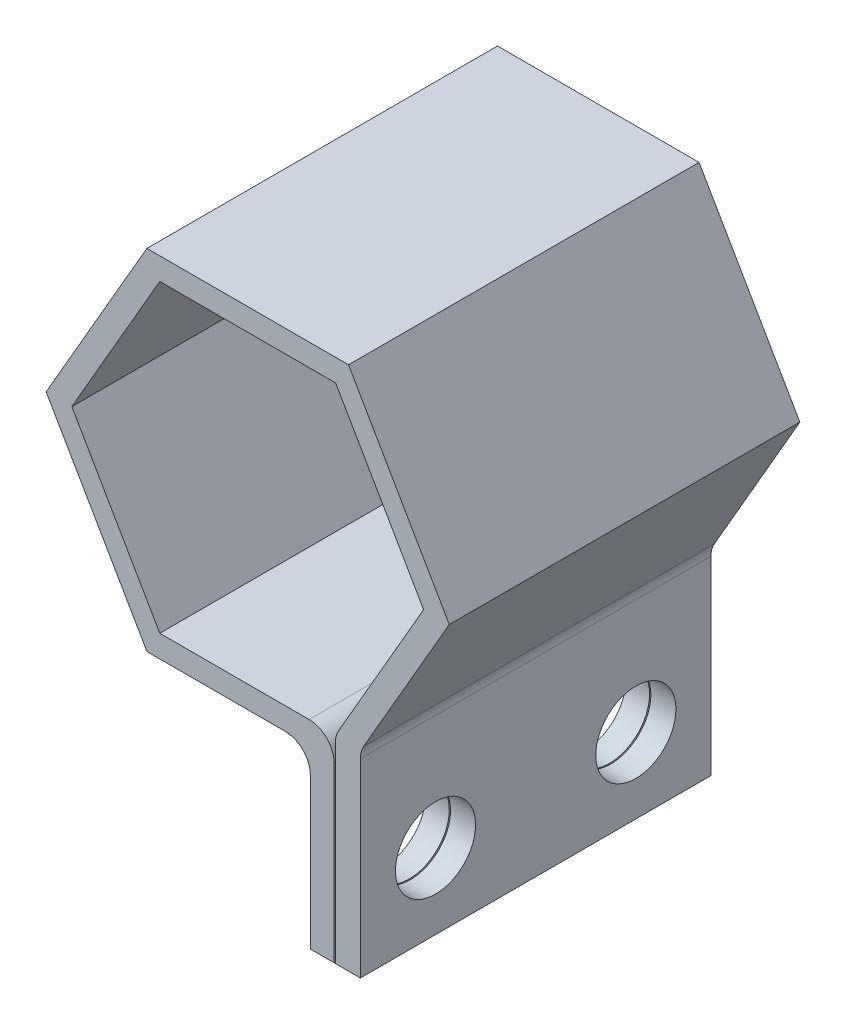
ISO-10303-21;
HEADER;
FILE_DESCRIPTION(('STEP AP214'),'2;1');
FILE_NAME('part.step','',(''),(''),'','','');
FILE_SCHEMA(('AUTOMOTIVE_DESIGN { 1 0 10303 214 1 1 1 1 }'));
ENDSEC;
DATA;
#1=APPLICATION_CONTEXT('core data for automotive mechanical design processes');
#2=APPLICATION_PROTOCOL_DEFINITION('international standard','automotive_design',2000,#1);
#3=PRODUCT_CONTEXT('',#1,'mechanical');
#4=PRODUCT('Part','Part','',(#3));
#5=PRODUCT_RELATED_PRODUCT_CATEGORY('part','',(#4));
#6=PRODUCT_DEFINITION_FORMATION('','',#4);
#7=PRODUCT_DEFINITION_CONTEXT('part definition',#1,'design');
#8=PRODUCT_DEFINITION('design','',#6,#7);
#9=PRODUCT_DEFINITION_SHAPE('','',#8);
#10=(LENGTH_UNIT() NAMED_UNIT(*) SI_UNIT(.MILLI.,.METRE.));
#11=(NAMED_UNIT(*) PLANE_ANGLE_UNIT() SI_UNIT($,.RADIAN.));
#12=(NAMED_UNIT(*) SI_UNIT($,.STERADIAN.) SOLID_ANGLE_UNIT());
#13=UNCERTAINTY_MEASURE_WITH_UNIT(LENGTH_MEASURE(1.E-05),#10,'distance_accuracy_value','');
#14=(GEOMETRIC_REPRESENTATION_CONTEXT(3) GLOBAL_UNCERTAINTY_ASSIGNED_CONTEXT((#13)) GLOBAL_UNIT_ASSIGNED_CONTEXT((#10,
#11,#12)) REPRESENTATION_CONTEXT('',''));
#15=CARTESIAN_POINT('',(0.,0.,0.));
#16=DIRECTION('',(0.,0.,1.));
#17=DIRECTION('',(1.,0.,0.));
#18=AXIS2_PLACEMENT_3D('',#15,#16,#17);
#19=CARTESIAN_POINT('',(4.63397459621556,-5.91672955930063,14.));
#20=DIRECTION('',(-0.866025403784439,0.499999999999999,0.));
#21=DIRECTION('',(-0.499999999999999,-0.866025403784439,0.));
#22=AXIS2_PLACEMENT_3D('',#19,#20,#21);
#23=PLANE('',#22);
#24=DIRECTION('',(0.499999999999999,0.866025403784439,0.));
#25=VECTOR('',#24,1.);
#26=CARTESIAN_POINT('',(4.63397459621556,-5.91672955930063,0.));
#27=LINE('',#26,#25);
#28=CARTESIAN_POINT('',(4.63397459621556,-5.91672955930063,0.));
#29=VERTEX_POINT('',#28);
#30=CARTESIAN_POINT('',(8.05,0.,0.));
#31=VERTEX_POINT('',#30);
#32=EDGE_CURVE('E212',#29,#31,#27,.T.);
#33=ORIENTED_EDGE('',*,*,#32,.T.);
#34=DIRECTION('',(0.,0.,-1.));
#35=VECTOR('',#34,1.);
#36=CARTESIAN_POINT('',(8.05,0.,14.));
#37=LINE('',#36,#35);
#38=CARTESIAN_POINT('',(8.05,0.,14.));
#39=VERTEX_POINT('',#38);
#40=EDGE_CURVE('E11',#39,#31,#37,.T.);
#41=ORIENTED_EDGE('',*,*,#40,.F.);
#42=DIRECTION('',(0.499999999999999,0.866025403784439,0.));
#43=VECTOR('',#42,1.);
#44=CARTESIAN_POINT('',(4.63397459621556,-5.91672955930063,14.));
#45=LINE('',#44,#43);
#46=CARTESIAN_POINT('',(4.63397459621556,-5.91672955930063,14.));
#47=VERTEX_POINT('',#46);
#48=EDGE_CURVE('E255',#47,#39,#45,.T.);
#49=ORIENTED_EDGE('',*,*,#48,.F.);
#50=DIRECTION('',(0.,0.,-1.));
#51=VECTOR('',#50,1.);
#52=CARTESIAN_POINT('',(4.63397459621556,-5.91672955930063,14.));
#53=LINE('',#52,#51);
#54=EDGE_CURVE('E208',#47,#29,#53,.T.);
#55=ORIENTED_EDGE('',*,*,#54,.T.);
#56=EDGE_LOOP('',(#33,#41,#49,#55));
#57=FACE_BOUND('',#56,.T.);
#58=ADVANCED_FACE('F32',(#57),#23,.F.);
#59=CARTESIAN_POINT('',(8.05,0.,14.));
#60=DIRECTION('',(-0.866025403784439,-0.5,0.));
#61=DIRECTION('',(0.5,-0.866025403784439,0.));
#62=AXIS2_PLACEMENT_3D('',#59,#60,#61);
#63=PLANE('',#62);
#64=DIRECTION('',(-0.5,0.866025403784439,0.));
#65=VECTOR('',#64,1.);
#66=CARTESIAN_POINT('',(8.05,0.,0.));
#67=LINE('',#66,#65);
#68=CARTESIAN_POINT('',(4.025,6.97150450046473,0.));
#69=VERTEX_POINT('',#68);
#70=EDGE_CURVE('E215',#31,#69,#67,.T.);
#71=ORIENTED_EDGE('',*,*,#70,.T.);
#72=DIRECTION('',(0.,0.,-1.));
#73=VECTOR('',#72,1.);
#74=CARTESIAN_POINT('',(4.025,6.97150450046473,14.));
#75=LINE('',#74,#73);
#76=CARTESIAN_POINT('',(4.025,6.97150450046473,14.));
#77=VERTEX_POINT('',#76);
#78=EDGE_CURVE('E40',#77,#69,#75,.T.);
#79=ORIENTED_EDGE('',*,*,#78,.F.);
#80=DIRECTION('',(-0.5,0.866025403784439,0.));
#81=VECTOR('',#80,1.);
#82=CARTESIAN_POINT('',(8.05,0.,14.));
#83=LINE('',#82,#81);
#84=EDGE_CURVE('E133',#39,#77,#83,.T.);
#85=ORIENTED_EDGE('',*,*,#84,.F.);
#86=ORIENTED_EDGE('',*,*,#40,.T.);
#87=EDGE_LOOP('',(#71,#79,#85,#86));
#88=FACE_BOUND('',#87,.T.);
#89=ADVANCED_FACE('F384',(#88),#63,.F.);
#90=CARTESIAN_POINT('',(4.025,6.97150450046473,14.));
#91=DIRECTION('',(0.,-1.,0.));
#92=DIRECTION('',(0.,0.,-1.));
#93=AXIS2_PLACEMENT_3D('',#90,#91,#92);
#94=PLANE('',#93);
#95=DIRECTION('',(-1.,0.,0.));
#96=VECTOR('',#95,1.);
#97=CARTESIAN_POINT('',(4.025,6.97150450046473,0.));
#98=LINE('',#97,#96);
#99=CARTESIAN_POINT('',(-4.025,6.97150450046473,0.));
#100=VERTEX_POINT('',#99);
#101=EDGE_CURVE('E218',#69,#100,#98,.T.);
#102=ORIENTED_EDGE('',*,*,#101,.T.);
#103=DIRECTION('',(0.,0.,-1.));
#104=VECTOR('',#103,1.);
#105=CARTESIAN_POINT('',(-4.025,6.97150450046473,14.));
#106=LINE('',#105,#104);
#107=CARTESIAN_POINT('',(-4.025,6.97150450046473,14.));
#108=VERTEX_POINT('',#107);
#109=EDGE_CURVE('E304',#108,#100,#106,.T.);
#110=ORIENTED_EDGE('',*,*,#109,.F.);
#111=DIRECTION('',(-1.,0.,0.));
#112=VECTOR('',#111,1.);
#113=CARTESIAN_POINT('',(4.025,6.97150450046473,14.));
#114=LINE('',#113,#112);
#115=EDGE_CURVE('E312',#77,#108,#114,.T.);
#116=ORIENTED_EDGE('',*,*,#115,.F.);
#117=ORIENTED_EDGE('',*,*,#78,.T.);
#118=EDGE_LOOP('',(#102,#110,#116,#117));
#119=FACE_BOUND('',#118,.T.);
#120=ADVANCED_FACE('F310',(#119),#94,.F.);
#121=CARTESIAN_POINT('',(-4.025,6.97150450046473,14.));
#122=DIRECTION('',(0.866025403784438,-0.500000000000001,0.));
#123=DIRECTION('',(0.500000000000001,0.866025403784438,0.));
#124=AXIS2_PLACEMENT_3D('',#121,#122,#123);
#125=PLANE('',#124);
#126=DIRECTION('',(-0.500000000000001,-0.866025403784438,0.));
#127=VECTOR('',#126,1.);
#128=CARTESIAN_POINT('',(-4.025,6.97150450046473,0.));
#129=LINE('',#128,#127);
#130=CARTESIAN_POINT('',(-8.05,0.,0.));
#131=VERTEX_POINT('',#130);
#132=EDGE_CURVE('E220',#100,#131,#129,.T.);
#133=ORIENTED_EDGE('',*,*,#132,.T.);
#134=DIRECTION('',(0.,0.,-1.));
#135=VECTOR('',#134,1.);
#136=CARTESIAN_POINT('',(-8.05,0.,14.));
#137=LINE('',#136,#135);
#138=CARTESIAN_POINT('',(-8.05,0.,14.));
#139=VERTEX_POINT('',#138);
#140=EDGE_CURVE('E301',#139,#131,#137,.T.);
#141=ORIENTED_EDGE('',*,*,#140,.F.);
#142=DIRECTION('',(-0.500000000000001,-0.866025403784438,0.));
#143=VECTOR('',#142,1.);
#144=CARTESIAN_POINT('',(-4.025,6.97150450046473,14.));
#145=LINE('',#144,#143);
#146=EDGE_CURVE('E330',#108,#139,#145,.T.);
#147=ORIENTED_EDGE('',*,*,#146,.F.);
#148=ORIENTED_EDGE('',*,*,#109,.T.);
#149=EDGE_LOOP('',(#133,#141,#147,#148));
#150=FACE_BOUND('',#149,.T.);
#151=ADVANCED_FACE('F321',(#150),#125,.F.);
#152=CARTESIAN_POINT('',(-8.05,0.,14.));
#153=DIRECTION('',(0.866025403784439,0.5,0.));
#154=DIRECTION('',(-0.5,0.866025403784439,0.));
#155=AXIS2_PLACEMENT_3D('',#152,#153,#154);
#156=PLANE('',#155);
#157=DIRECTION('',(0.5,-0.866025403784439,0.));
#158=VECTOR('',#157,1.);
#159=CARTESIAN_POINT('',(-8.05,0.,0.));
#160=LINE('',#159,#158);
#161=CARTESIAN_POINT('',(-4.025,-6.97150450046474,0.));
#162=VERTEX_POINT('',#161);
#163=EDGE_CURVE('E222',#131,#162,#160,.T.);
#164=ORIENTED_EDGE('',*,*,#163,.T.);
#165=DIRECTION('',(0.,0.,-1.));
#166=VECTOR('',#165,1.);
#167=CARTESIAN_POINT('',(-4.025,-6.97150450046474,14.));
#168=LINE('',#167,#166);
#169=CARTESIAN_POINT('',(-4.025,-6.97150450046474,14.));
#170=VERTEX_POINT('',#169);
#171=EDGE_CURVE('E298',#170,#162,#168,.T.);
#172=ORIENTED_EDGE('',*,*,#171,.F.);
#173=DIRECTION('',(0.5,-0.866025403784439,0.));
#174=VECTOR('',#173,1.);
#175=CARTESIAN_POINT('',(-8.05,0.,14.));
#176=LINE('',#175,#174);
#177=EDGE_CURVE('E327',#139,#170,#176,.T.);
#178=ORIENTED_EDGE('',*,*,#177,.F.);
#179=ORIENTED_EDGE('',*,*,#140,.T.);
#180=EDGE_LOOP('',(#164,#172,#178,#179));
#181=FACE_BOUND('',#180,.T.);
#182=ADVANCED_FACE('F325',(#181),#156,.F.);
#183=CARTESIAN_POINT('',(-4.025,-6.97150450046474,14.));
#184=DIRECTION('',(0.,1.,0.));
#185=DIRECTION('',(-1.,0.,0.));
#186=AXIS2_PLACEMENT_3D('',#183,#184,#185);
#187=PLANE('',#186);
#188=DIRECTION('',(1.,0.,0.));
#189=VECTOR('',#188,1.);
#190=CARTESIAN_POINT('',(-4.025,-6.97150450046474,0.));
#191=LINE('',#190,#189);
#192=CARTESIAN_POINT('',(1.49999999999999,-6.97150450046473,0.));
#193=VERTEX_POINT('',#192);
#194=EDGE_CURVE('E224',#162,#193,#191,.T.);
#195=ORIENTED_EDGE('',*,*,#194,.T.);
#196=DIRECTION('',(0.,0.,-1.));
#197=VECTOR('',#196,1.);
#198=CARTESIAN_POINT('',(1.49999999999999,-6.97150450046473,14.));
#199=LINE('',#198,#197);
#200=CARTESIAN_POINT('',(1.49999999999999,-6.97150450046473,14.));
#201=VERTEX_POINT('',#200);
#202=EDGE_CURVE('E295',#201,#193,#199,.T.);
#203=ORIENTED_EDGE('',*,*,#202,.F.);
#204=DIRECTION('',(1.,0.,0.));
#205=VECTOR('',#204,1.);
#206=CARTESIAN_POINT('',(-4.025,-6.97150450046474,14.));
#207=LINE('',#206,#205);
#208=EDGE_CURVE('E329',#170,#201,#207,.T.);
#209=ORIENTED_EDGE('',*,*,#208,.F.);
#210=ORIENTED_EDGE('',*,*,#171,.T.);
#211=EDGE_LOOP('',(#195,#203,#209,#210));
#212=FACE_BOUND('',#211,.T.);
#213=ADVANCED_FACE('F397',(#212),#187,.F.);
#214=CARTESIAN_POINT('',(1.5,-7.97150450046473,14.));
#215=DIRECTION('',(0.,0.,-1.));
#216=DIRECTION('',(-1.,0.,0.));
#217=AXIS2_PLACEMENT_3D('',#214,#215,#216);
#218=CYLINDRICAL_SURFACE('',#217,1.);
#219=CARTESIAN_POINT('',(1.5,-7.97150450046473,0.));
#220=DIRECTION('',(0.,0.,-1.));
#221=DIRECTION('',(-1.,0.,0.));
#222=AXIS2_PLACEMENT_3D('',#219,#220,#221);
#223=CIRCLE('',#222,1.);
#224=CARTESIAN_POINT('',(2.5,-7.97150450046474,0.));
#225=VERTEX_POINT('',#224);
#226=EDGE_CURVE('E226',#193,#225,#223,.T.);
#227=ORIENTED_EDGE('',*,*,#226,.T.);
#228=DIRECTION('',(0.,0.,-1.));
#229=VECTOR('',#228,1.);
#230=CARTESIAN_POINT('',(2.5,-7.97150450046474,14.));
#231=LINE('',#230,#229);
#232=CARTESIAN_POINT('',(2.5,-7.97150450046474,14.));
#233=VERTEX_POINT('',#232);
#234=EDGE_CURVE('E292',#233,#225,#231,.T.);
#235=ORIENTED_EDGE('',*,*,#234,.F.);
#236=CARTESIAN_POINT('',(1.5,-7.97150450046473,14.));
#237=DIRECTION('',(0.,0.,-1.));
#238=DIRECTION('',(-1.,0.,0.));
#239=AXIS2_PLACEMENT_3D('',#236,#237,#238);
#240=CIRCLE('',#239,1.);
#241=EDGE_CURVE('E332',#201,#233,#240,.T.);
#242=ORIENTED_EDGE('',*,*,#241,.F.);
#243=ORIENTED_EDGE('',*,*,#202,.T.);
#244=EDGE_LOOP('',(#227,#235,#242,#243));
#245=FACE_BOUND('',#244,.T.);
#246=ADVANCED_FACE('F400',(#245),#218,.F.);
#247=CARTESIAN_POINT('',(2.5,-7.97150450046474,14.));
#248=DIRECTION('',(1.,0.,0.));
#249=DIRECTION('',(0.,1.,0.));
#250=AXIS2_PLACEMENT_3D('',#247,#248,#249);
#251=PLANE('',#250);
#252=CARTESIAN_POINT('',(2.5,-11.,3.));
#253=DIRECTION('',(1.,0.,0.));
#254=DIRECTION('',(0.,1.,0.));
#255=AXIS2_PLACEMENT_3D('',#252,#253,#254);
#256=CIRCLE('',#255,1.6);
#257=CARTESIAN_POINT('',(2.5,-9.4,3.));
#258=VERTEX_POINT('',#257);
#259=EDGE_CURVE('E631',#258,#258,#256,.F.);
#260=ORIENTED_EDGE('',*,*,#259,.F.);
#261=EDGE_LOOP('',(#260));
#262=FACE_BOUND('',#261,.T.);
#263=CARTESIAN_POINT('',(2.5,-11.,11.));
#264=DIRECTION('',(1.,0.,0.));
#265=DIRECTION('',(0.,1.,0.));
#266=AXIS2_PLACEMENT_3D('',#263,#264,#265);
#267=CIRCLE('',#266,1.6);
#268=CARTESIAN_POINT('',(2.5,-9.4,11.));
#269=VERTEX_POINT('',#268);
#270=EDGE_CURVE('E639',#269,#269,#267,.F.);
#271=ORIENTED_EDGE('',*,*,#270,.F.);
#272=EDGE_LOOP('',(#271));
#273=FACE_BOUND('',#272,.T.);
#274=DIRECTION('',(0.,-1.,0.));
#275=VECTOR('',#274,1.);
#276=CARTESIAN_POINT('',(2.5,-7.97150450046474,0.));
#277=LINE('',#276,#275);
#278=CARTESIAN_POINT('',(2.5,-14.,0.));
#279=VERTEX_POINT('',#278);
#280=EDGE_CURVE('E228',#225,#279,#277,.T.);
#281=ORIENTED_EDGE('',*,*,#280,.T.);
#282=DIRECTION('',(0.,0.,-1.));
#283=VECTOR('',#282,1.);
#284=CARTESIAN_POINT('',(2.5,-14.,14.));
#285=LINE('',#284,#283);
#286=CARTESIAN_POINT('',(2.5,-14.,14.));
#287=VERTEX_POINT('',#286);
#288=EDGE_CURVE('E289',#287,#279,#285,.T.);
#289=ORIENTED_EDGE('',*,*,#288,.F.);
#290=DIRECTION('',(0.,-1.,0.));
#291=VECTOR('',#290,1.);
#292=CARTESIAN_POINT('',(2.5,-7.97150450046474,14.));
#293=LINE('',#292,#291);
#294=EDGE_CURVE('E338',#233,#287,#293,.T.);
#295=ORIENTED_EDGE('',*,*,#294,.F.);
#296=ORIENTED_EDGE('',*,*,#234,.T.);
#297=EDGE_LOOP('',(#281,#289,#295,#296));
#298=FACE_BOUND('',#297,.T.);
#299=ADVANCED_FACE('F404',(#262,#273,#298),#251,.F.);
#300=CARTESIAN_POINT('',(3.45,-14.,14.));
#301=DIRECTION('',(0.,1.,0.));
#302=DIRECTION('',(0.,0.,1.));
#303=AXIS2_PLACEMENT_3D('',#300,#301,#302);
#304=PLANE('',#303);
#305=DIRECTION('',(1.,0.,0.));
#306=VECTOR('',#305,1.);
#307=CARTESIAN_POINT('',(3.45,-14.,0.));
#308=LINE('',#307,#306);
#309=CARTESIAN_POINT('',(3.45,-14.,0.));
#310=VERTEX_POINT('',#309);
#311=EDGE_CURVE('E230',#279,#310,#308,.T.);
#312=ORIENTED_EDGE('',*,*,#311,.T.);
#313=DIRECTION('',(0.,0.,-1.));
#314=VECTOR('',#313,1.);
#315=CARTESIAN_POINT('',(3.45,-14.,14.));
#316=LINE('',#315,#314);
#317=CARTESIAN_POINT('',(3.45,-14.,14.));
#318=VERTEX_POINT('',#317);
#319=EDGE_CURVE('E286',#318,#310,#316,.T.);
#320=ORIENTED_EDGE('',*,*,#319,.F.);
#321=DIRECTION('',(1.,0.,0.));
#322=VECTOR('',#321,1.);
#323=CARTESIAN_POINT('',(3.45,-14.,14.));
#324=LINE('',#323,#322);
#325=EDGE_CURVE('E340',#287,#318,#324,.T.);
#326=ORIENTED_EDGE('',*,*,#325,.F.);
#327=ORIENTED_EDGE('',*,*,#288,.T.);
#328=EDGE_LOOP('',(#312,#320,#326,#327));
#329=FACE_BOUND('',#328,.T.);
#330=ADVANCED_FACE('F408',(#329),#304,.F.);
#331=CARTESIAN_POINT('',(3.45,-7.08382846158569,14.));
#332=DIRECTION('',(-1.,0.,0.));
#333=DIRECTION('',(0.,-1.,0.));
#334=AXIS2_PLACEMENT_3D('',#331,#332,#333);
#335=PLANE('',#334);
#336=CARTESIAN_POINT('',(3.45,-11.,3.));
#337=DIRECTION('',(-1.,0.,0.));
#338=DIRECTION('',(0.,-1.,0.));
#339=AXIS2_PLACEMENT_3D('',#336,#337,#338);
#340=CIRCLE('',#339,1.6);
#341=CARTESIAN_POINT('',(3.45,-9.4,3.));
#342=VERTEX_POINT('',#341);
#343=EDGE_CURVE('E634',#342,#342,#340,.T.);
#344=ORIENTED_EDGE('',*,*,#343,.T.);
#345=EDGE_LOOP('',(#344));
#346=FACE_BOUND('',#345,.T.);
#347=CARTESIAN_POINT('',(3.45,-11.,11.));
#348=DIRECTION('',(-1.,0.,0.));
#349=DIRECTION('',(0.,-1.,0.));
#350=AXIS2_PLACEMENT_3D('',#347,#348,#349);
#351=CIRCLE('',#350,1.6);
#352=CARTESIAN_POINT('',(3.45,-9.4,11.));
#353=VERTEX_POINT('',#352);
#354=EDGE_CURVE('E216',#353,#353,#351,.T.);
#355=ORIENTED_EDGE('',*,*,#354,.T.);
#356=EDGE_LOOP('',(#355));
#357=FACE_BOUND('',#356,.T.);
#358=DIRECTION('',(0.,1.,0.));
#359=VECTOR('',#358,1.);
#360=CARTESIAN_POINT('',(3.45,-7.08382846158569,0.));
#361=LINE('',#360,#359);
#362=CARTESIAN_POINT('',(3.45,-7.08382846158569,0.));
#363=VERTEX_POINT('',#362);
#364=EDGE_CURVE('E232',#310,#363,#361,.T.);
#365=ORIENTED_EDGE('',*,*,#364,.T.);
#366=DIRECTION('',(0.,0.,-1.));
#367=VECTOR('',#366,1.);
#368=CARTESIAN_POINT('',(3.45,-7.08382846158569,14.));
#369=LINE('',#368,#367);
#370=CARTESIAN_POINT('',(3.45,-7.08382846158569,14.));
#371=VERTEX_POINT('',#370);
#372=EDGE_CURVE('E283',#371,#363,#369,.T.);
#373=ORIENTED_EDGE('',*,*,#372,.F.);
#374=DIRECTION('',(0.,1.,0.));
#375=VECTOR('',#374,1.);
#376=CARTESIAN_POINT('',(3.45,-7.08382846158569,14.));
#377=LINE('',#376,#375);
#378=EDGE_CURVE('E342',#318,#371,#377,.T.);
#379=ORIENTED_EDGE('',*,*,#378,.F.);
#380=ORIENTED_EDGE('',*,*,#319,.T.);
#381=EDGE_LOOP('',(#365,#373,#379,#380));
#382=FACE_BOUND('',#381,.T.);
#383=ADVANCED_FACE('F412',(#346,#357,#382),#335,.F.);
#384=CARTESIAN_POINT('',(2.45,-7.08382846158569,14.));
#385=DIRECTION('',(0.,0.,-1.));
#386=DIRECTION('',(-1.,0.,0.));
#387=AXIS2_PLACEMENT_3D('',#384,#385,#386);
#388=CYLINDRICAL_SURFACE('',#387,1.);
#389=CARTESIAN_POINT('',(2.45,-7.08382846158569,0.));
#390=DIRECTION('',(0.,0.,1.));
#391=DIRECTION('',(1.,0.,0.));
#392=AXIS2_PLACEMENT_3D('',#389,#390,#391);
#393=CIRCLE('',#392,1.);
#394=CARTESIAN_POINT('',(2.44999999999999,-6.08382846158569,0.));
#395=VERTEX_POINT('',#394);
#396=EDGE_CURVE('E234',#363,#395,#393,.T.);
#397=ORIENTED_EDGE('',*,*,#396,.T.);
#398=DIRECTION('',(0.,0.,-1.));
#399=VECTOR('',#398,1.);
#400=CARTESIAN_POINT('',(2.44999999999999,-6.08382846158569,14.));
#401=LINE('',#400,#399);
#402=CARTESIAN_POINT('',(2.44999999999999,-6.08382846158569,14.));
#403=VERTEX_POINT('',#402);
#404=EDGE_CURVE('E280',#403,#395,#401,.T.);
#405=ORIENTED_EDGE('',*,*,#404,.F.);
#406=CARTESIAN_POINT('',(2.45,-7.08382846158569,14.));
#407=DIRECTION('',(0.,0.,1.));
#408=DIRECTION('',(1.,0.,0.));
#409=AXIS2_PLACEMENT_3D('',#406,#407,#408);
#410=CIRCLE('',#409,1.);
#411=EDGE_CURVE('E344',#371,#403,#410,.T.);
#412=ORIENTED_EDGE('',*,*,#411,.F.);
#413=ORIENTED_EDGE('',*,*,#372,.T.);
#414=EDGE_LOOP('',(#397,#405,#412,#413));
#415=FACE_BOUND('',#414,.T.);
#416=ADVANCED_FACE('F416',(#415),#388,.T.);
#417=CARTESIAN_POINT('',(-3.5125,-6.08382846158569,14.));
#418=DIRECTION('',(0.,-1.,0.));
#419=DIRECTION('',(0.,0.,-1.));
#420=AXIS2_PLACEMENT_3D('',#417,#418,#419);
#421=PLANE('',#420);
#422=DIRECTION('',(-1.,0.,0.));
#423=VECTOR('',#422,1.);
#424=CARTESIAN_POINT('',(-3.5125,-6.08382846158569,0.));
#425=LINE('',#424,#423);
#426=CARTESIAN_POINT('',(-3.5125,-6.08382846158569,0.));
#427=VERTEX_POINT('',#426);
#428=EDGE_CURVE('E236',#395,#427,#425,.T.);
#429=ORIENTED_EDGE('',*,*,#428,.T.);
#430=DIRECTION('',(0.,0.,-1.));
#431=VECTOR('',#430,1.);
#432=CARTESIAN_POINT('',(-3.5125,-6.08382846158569,14.));
#433=LINE('',#432,#431);
#434=CARTESIAN_POINT('',(-3.5125,-6.08382846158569,14.));
#435=VERTEX_POINT('',#434);
#436=EDGE_CURVE('E277',#435,#427,#433,.T.);
#437=ORIENTED_EDGE('',*,*,#436,.F.);
#438=DIRECTION('',(-1.,0.,0.));
#439=VECTOR('',#438,1.);
#440=CARTESIAN_POINT('',(-3.5125,-6.08382846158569,14.));
#441=LINE('',#440,#439);
#442=EDGE_CURVE('E346',#403,#435,#441,.T.);
#443=ORIENTED_EDGE('',*,*,#442,.F.);
#444=ORIENTED_EDGE('',*,*,#404,.T.);
#445=EDGE_LOOP('',(#429,#437,#443,#444));
#446=FACE_BOUND('',#445,.T.);
#447=ADVANCED_FACE('F420',(#446),#421,.F.);
#448=CARTESIAN_POINT('',(-7.025,0.,14.));
#449=DIRECTION('',(-0.866025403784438,-0.5,0.));
#450=DIRECTION('',(0.5,-0.866025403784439,0.));
#451=AXIS2_PLACEMENT_3D('',#448,#449,#450);
#452=PLANE('',#451);
#453=DIRECTION('',(-0.5,0.866025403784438,0.));
#454=VECTOR('',#453,1.);
#455=CARTESIAN_POINT('',(-7.025,0.,0.));
#456=LINE('',#455,#454);
#457=CARTESIAN_POINT('',(-7.025,0.,0.));
#458=VERTEX_POINT('',#457);
#459=EDGE_CURVE('E238',#427,#458,#456,.T.);
#460=ORIENTED_EDGE('',*,*,#459,.T.);
#461=DIRECTION('',(0.,0.,-1.));
#462=VECTOR('',#461,1.);
#463=CARTESIAN_POINT('',(-7.025,0.,14.));
#464=LINE('',#463,#462);
#465=CARTESIAN_POINT('',(-7.025,0.,14.));
#466=VERTEX_POINT('',#465);
#467=EDGE_CURVE('E274',#466,#458,#464,.T.);
#468=ORIENTED_EDGE('',*,*,#467,.F.);
#469=DIRECTION('',(-0.5,0.866025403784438,0.));
#470=VECTOR('',#469,1.);
#471=CARTESIAN_POINT('',(-7.025,0.,14.));
#472=LINE('',#471,#470);
#473=EDGE_CURVE('E348',#435,#466,#472,.T.);
#474=ORIENTED_EDGE('',*,*,#473,.F.);
#475=ORIENTED_EDGE('',*,*,#436,.T.);
#476=EDGE_LOOP('',(#460,#468,#474,#475));
#477=FACE_BOUND('',#476,.T.);
#478=ADVANCED_FACE('F424',(#477),#452,.F.);
#479=CARTESIAN_POINT('',(-3.51250000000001,6.08382846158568,14.));
#480=DIRECTION('',(-0.866025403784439,0.5,0.));
#481=DIRECTION('',(-0.5,-0.866025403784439,0.));
#482=AXIS2_PLACEMENT_3D('',#479,#480,#481);
#483=PLANE('',#482);
#484=DIRECTION('',(0.5,0.866025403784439,0.));
#485=VECTOR('',#484,1.);
#486=CARTESIAN_POINT('',(-3.51250000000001,6.08382846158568,0.));
#487=LINE('',#486,#485);
#488=CARTESIAN_POINT('',(-3.51250000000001,6.08382846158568,0.));
#489=VERTEX_POINT('',#488);
#490=EDGE_CURVE('E240',#458,#489,#487,.T.);
#491=ORIENTED_EDGE('',*,*,#490,.T.);
#492=DIRECTION('',(0.,0.,-1.));
#493=VECTOR('',#492,1.);
#494=CARTESIAN_POINT('',(-3.51250000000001,6.08382846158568,14.));
#495=LINE('',#494,#493);
#496=CARTESIAN_POINT('',(-3.51250000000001,6.08382846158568,14.));
#497=VERTEX_POINT('',#496);
#498=EDGE_CURVE('E271',#497,#489,#495,.T.);
#499=ORIENTED_EDGE('',*,*,#498,.F.);
#500=DIRECTION('',(0.5,0.866025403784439,0.));
#501=VECTOR('',#500,1.);
#502=CARTESIAN_POINT('',(-3.51250000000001,6.08382846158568,14.));
#503=LINE('',#502,#501);
#504=EDGE_CURVE('E350',#466,#497,#503,.T.);
#505=ORIENTED_EDGE('',*,*,#504,.F.);
#506=ORIENTED_EDGE('',*,*,#467,.T.);
#507=EDGE_LOOP('',(#491,#499,#505,#506));
#508=FACE_BOUND('',#507,.T.);
#509=ADVANCED_FACE('F428',(#508),#483,.F.);
#510=CARTESIAN_POINT('',(3.5125,6.08382846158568,14.));
#511=DIRECTION('',(0.,1.,0.));
#512=DIRECTION('',(0.,0.,1.));
#513=AXIS2_PLACEMENT_3D('',#510,#511,#512);
#514=PLANE('',#513);
#515=DIRECTION('',(1.,0.,0.));
#516=VECTOR('',#515,1.);
#517=CARTESIAN_POINT('',(3.5125,6.08382846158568,0.));
#518=LINE('',#517,#516);
#519=CARTESIAN_POINT('',(3.5125,6.08382846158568,0.));
#520=VERTEX_POINT('',#519);
#521=EDGE_CURVE('E242',#489,#520,#518,.T.);
#522=ORIENTED_EDGE('',*,*,#521,.T.);
#523=DIRECTION('',(0.,0.,-1.));
#524=VECTOR('',#523,1.);
#525=CARTESIAN_POINT('',(3.5125,6.08382846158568,14.));
#526=LINE('',#525,#524);
#527=CARTESIAN_POINT('',(3.5125,6.08382846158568,14.));
#528=VERTEX_POINT('',#527);
#529=EDGE_CURVE('E268',#528,#520,#526,.T.);
#530=ORIENTED_EDGE('',*,*,#529,.F.);
#531=DIRECTION('',(1.,0.,0.));
#532=VECTOR('',#531,1.);
#533=CARTESIAN_POINT('',(3.5125,6.08382846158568,14.));
#534=LINE('',#533,#532);
#535=EDGE_CURVE('E352',#497,#528,#534,.T.);
#536=ORIENTED_EDGE('',*,*,#535,.F.);
#537=ORIENTED_EDGE('',*,*,#498,.T.);
#538=EDGE_LOOP('',(#522,#530,#536,#537));
#539=FACE_BOUND('',#538,.T.);
#540=ADVANCED_FACE('F432',(#539),#514,.F.);
#541=CARTESIAN_POINT('',(7.025,0.,14.));
#542=DIRECTION('',(0.866025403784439,0.5,0.));
#543=DIRECTION('',(-0.5,0.866025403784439,0.));
#544=AXIS2_PLACEMENT_3D('',#541,#542,#543);
#545=PLANE('',#544);
#546=DIRECTION('',(0.5,-0.866025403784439,0.));
#547=VECTOR('',#546,1.);
#548=CARTESIAN_POINT('',(7.025,0.,0.));
#549=LINE('',#548,#547);
#550=CARTESIAN_POINT('',(7.025,0.,0.));
#551=VERTEX_POINT('',#550);
#552=EDGE_CURVE('E244',#520,#551,#549,.T.);
#553=ORIENTED_EDGE('',*,*,#552,.T.);
#554=DIRECTION('',(0.,0.,-1.));
#555=VECTOR('',#554,1.);
#556=CARTESIAN_POINT('',(7.025,0.,14.));
#557=LINE('',#556,#555);
#558=CARTESIAN_POINT('',(7.025,0.,14.));
#559=VERTEX_POINT('',#558);
#560=EDGE_CURVE('E265',#559,#551,#557,.T.);
#561=ORIENTED_EDGE('',*,*,#560,.F.);
#562=DIRECTION('',(0.5,-0.866025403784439,0.));
#563=VECTOR('',#562,1.);
#564=CARTESIAN_POINT('',(7.025,0.,14.));
#565=LINE('',#564,#563);
#566=EDGE_CURVE('E354',#528,#559,#565,.T.);
#567=ORIENTED_EDGE('',*,*,#566,.F.);
#568=ORIENTED_EDGE('',*,*,#529,.T.);
#569=EDGE_LOOP('',(#553,#561,#567,#568));
#570=FACE_BOUND('',#569,.T.);
#571=ADVANCED_FACE('F436',(#570),#545,.F.);
#572=CARTESIAN_POINT('',(3.63397459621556,-5.87342828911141,14.));
#573=DIRECTION('',(0.866025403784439,-0.5,0.));
#574=DIRECTION('',(0.5,0.866025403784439,0.));
#575=AXIS2_PLACEMENT_3D('',#572,#573,#574);
#576=PLANE('',#575);
#577=DIRECTION('',(-0.5,-0.866025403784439,0.));
#578=VECTOR('',#577,1.);
#579=CARTESIAN_POINT('',(3.63397459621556,-5.87342828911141,0.));
#580=LINE('',#579,#578);
#581=CARTESIAN_POINT('',(3.63397459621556,-5.87342828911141,0.));
#582=VERTEX_POINT('',#581);
#583=EDGE_CURVE('E246',#551,#582,#580,.T.);
#584=ORIENTED_EDGE('',*,*,#583,.T.);
#585=DIRECTION('',(0.,0.,-1.));
#586=VECTOR('',#585,1.);
#587=CARTESIAN_POINT('',(3.63397459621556,-5.87342828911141,14.));
#588=LINE('',#587,#586);
#589=CARTESIAN_POINT('',(3.63397459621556,-5.87342828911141,14.));
#590=VERTEX_POINT('',#589);
#591=EDGE_CURVE('E262',#590,#582,#588,.T.);
#592=ORIENTED_EDGE('',*,*,#591,.F.);
#593=DIRECTION('',(-0.5,-0.866025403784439,0.));
#594=VECTOR('',#593,1.);
#595=CARTESIAN_POINT('',(3.63397459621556,-5.87342828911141,14.));
#596=LINE('',#595,#594);
#597=EDGE_CURVE('E356',#559,#590,#596,.T.);
#598=ORIENTED_EDGE('',*,*,#597,.F.);
#599=ORIENTED_EDGE('',*,*,#560,.T.);
#600=EDGE_LOOP('',(#584,#592,#598,#599));
#601=FACE_BOUND('',#600,.T.);
#602=ADVANCED_FACE('F440',(#601),#576,.F.);
#603=CARTESIAN_POINT('',(4.5,-6.37342828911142,14.));
#604=DIRECTION('',(0.,0.,-1.));
#605=DIRECTION('',(-1.,0.,0.));
#606=AXIS2_PLACEMENT_3D('',#603,#604,#605);
#607=CYLINDRICAL_SURFACE('',#606,1.);
#608=CARTESIAN_POINT('',(4.5,-6.37342828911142,0.));
#609=DIRECTION('',(0.,0.,1.));
#610=DIRECTION('',(1.,0.,0.));
#611=AXIS2_PLACEMENT_3D('',#608,#609,#610);
#612=CIRCLE('',#611,1.);
#613=CARTESIAN_POINT('',(3.5,-6.37342828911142,0.));
#614=VERTEX_POINT('',#613);
#615=EDGE_CURVE('E248',#582,#614,#612,.T.);
#616=ORIENTED_EDGE('',*,*,#615,.T.);
#617=DIRECTION('',(0.,0.,-1.));
#618=VECTOR('',#617,1.);
#619=CARTESIAN_POINT('',(3.5,-6.37342828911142,14.));
#620=LINE('',#619,#618);
#621=CARTESIAN_POINT('',(3.5,-6.37342828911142,14.));
#622=VERTEX_POINT('',#621);
#623=EDGE_CURVE('E259',#622,#614,#620,.T.);
#624=ORIENTED_EDGE('',*,*,#623,.F.);
#625=CARTESIAN_POINT('',(4.5,-6.37342828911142,14.));
#626=DIRECTION('',(0.,0.,1.));
#627=DIRECTION('',(1.,0.,0.));
#628=AXIS2_PLACEMENT_3D('',#625,#626,#627);
#629=CIRCLE('',#628,1.);
#630=EDGE_CURVE('E358',#590,#622,#629,.T.);
#631=ORIENTED_EDGE('',*,*,#630,.F.);
#632=ORIENTED_EDGE('',*,*,#591,.T.);
#633=EDGE_LOOP('',(#616,#624,#631,#632));
#634=FACE_BOUND('',#633,.T.);
#635=ADVANCED_FACE('F364',(#634),#607,.T.);
#636=CARTESIAN_POINT('',(3.5,-6.37342828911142,14.));
#637=DIRECTION('',(1.,0.,0.));
#638=DIRECTION('',(0.,1.,0.));
#639=AXIS2_PLACEMENT_3D('',#636,#637,#638);
#640=PLANE('',#639);
#641=CARTESIAN_POINT('',(3.5,-11.,3.));
#642=DIRECTION('',(1.,0.,0.));
#643=DIRECTION('',(0.,1.,0.));
#644=AXIS2_PLACEMENT_3D('',#641,#642,#643);
#645=CIRCLE('',#644,1.6);
#646=CARTESIAN_POINT('',(3.5,-9.4,3.));
#647=VERTEX_POINT('',#646);
#648=EDGE_CURVE('E636',#647,#647,#645,.T.);
#649=ORIENTED_EDGE('',*,*,#648,.T.);
#650=EDGE_LOOP('',(#649));
#651=FACE_BOUND('',#650,.T.);
#652=CARTESIAN_POINT('',(3.5,-11.,11.));
#653=DIRECTION('',(1.,0.,0.));
#654=DIRECTION('',(0.,1.,0.));
#655=AXIS2_PLACEMENT_3D('',#652,#653,#654);
#656=CIRCLE('',#655,1.6);
#657=CARTESIAN_POINT('',(3.5,-9.4,11.));
#658=VERTEX_POINT('',#657);
#659=EDGE_CURVE('E647',#658,#658,#656,.T.);
#660=ORIENTED_EDGE('',*,*,#659,.T.);
#661=EDGE_LOOP('',(#660));
#662=FACE_BOUND('',#661,.T.);
#663=DIRECTION('',(0.,-1.,0.));
#664=VECTOR('',#663,1.);
#665=CARTESIAN_POINT('',(3.5,-6.37342828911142,0.));
#666=LINE('',#665,#664);
#667=CARTESIAN_POINT('',(3.5,-14.,0.));
#668=VERTEX_POINT('',#667);
#669=EDGE_CURVE('E250',#614,#668,#666,.T.);
#670=ORIENTED_EDGE('',*,*,#669,.T.);
#671=DIRECTION('',(0.,0.,-1.));
#672=VECTOR('',#671,1.);
#673=CARTESIAN_POINT('',(3.5,-14.,14.));
#674=LINE('',#673,#672);
#675=CARTESIAN_POINT('',(3.5,-14.,14.));
#676=VERTEX_POINT('',#675);
#677=EDGE_CURVE('E203',#676,#668,#674,.T.);
#678=ORIENTED_EDGE('',*,*,#677,.F.);
#679=DIRECTION('',(0.,-1.,0.));
#680=VECTOR('',#679,1.);
#681=CARTESIAN_POINT('',(3.5,-6.37342828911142,14.));
#682=LINE('',#681,#680);
#683=EDGE_CURVE('E194',#622,#676,#682,.T.);
#684=ORIENTED_EDGE('',*,*,#683,.F.);
#685=ORIENTED_EDGE('',*,*,#623,.T.);
#686=EDGE_LOOP('',(#670,#678,#684,#685));
#687=FACE_BOUND('',#686,.T.);
#688=ADVANCED_FACE('F368',(#651,#662,#687),#640,.F.);
#689=CARTESIAN_POINT('',(4.5,-14.,14.));
#690=DIRECTION('',(0.,1.,0.));
#691=DIRECTION('',(0.,0.,1.));
#692=AXIS2_PLACEMENT_3D('',#689,#690,#691);
#693=PLANE('',#692);
#694=DIRECTION('',(1.,0.,0.));
#695=VECTOR('',#694,1.);
#696=CARTESIAN_POINT('',(4.5,-14.,0.));
#697=LINE('',#696,#695);
#698=CARTESIAN_POINT('',(4.5,-14.,0.));
#699=VERTEX_POINT('',#698);
#700=EDGE_CURVE('E202',#668,#699,#697,.T.);
#701=ORIENTED_EDGE('',*,*,#700,.T.);
#702=DIRECTION('',(0.,0.,-1.));
#703=VECTOR('',#702,1.);
#704=CARTESIAN_POINT('',(4.5,-14.,14.));
#705=LINE('',#704,#703);
#706=CARTESIAN_POINT('',(4.5,-14.,14.));
#707=VERTEX_POINT('',#706);
#708=EDGE_CURVE('E199',#707,#699,#705,.T.);
#709=ORIENTED_EDGE('',*,*,#708,.F.);
#710=DIRECTION('',(1.,0.,0.));
#711=VECTOR('',#710,1.);
#712=CARTESIAN_POINT('',(4.5,-14.,14.));
#713=LINE('',#712,#711);
#714=EDGE_CURVE('E188',#676,#707,#713,.T.);
#715=ORIENTED_EDGE('',*,*,#714,.F.);
#716=ORIENTED_EDGE('',*,*,#677,.T.);
#717=EDGE_LOOP('',(#701,#709,#715,#716));
#718=FACE_BOUND('',#717,.T.);
#719=ADVANCED_FACE('F200',(#718),#693,.F.);
#720=CARTESIAN_POINT('',(4.5,-6.41672955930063,14.));
#721=DIRECTION('',(-1.,0.,0.));
#722=DIRECTION('',(0.,-1.,0.));
#723=AXIS2_PLACEMENT_3D('',#720,#721,#722);
#724=PLANE('',#723);
#725=CARTESIAN_POINT('',(4.5,-11.,3.));
#726=DIRECTION('',(1.,0.,0.));
#727=DIRECTION('',(0.,1.,0.));
#728=AXIS2_PLACEMENT_3D('',#725,#726,#727);
#729=CIRCLE('',#728,1.6);
#730=CARTESIAN_POINT('',(4.5,-9.4,3.));
#731=VERTEX_POINT('',#730);
#732=EDGE_CURVE('E696',#731,#731,#729,.T.);
#733=ORIENTED_EDGE('',*,*,#732,.F.);
#734=EDGE_LOOP('',(#733));
#735=FACE_BOUND('',#734,.T.);
#736=CARTESIAN_POINT('',(4.5,-11.,11.));
#737=DIRECTION('',(1.,0.,0.));
#738=DIRECTION('',(0.,1.,0.));
#739=AXIS2_PLACEMENT_3D('',#736,#737,#738);
#740=CIRCLE('',#739,1.6);
#741=CARTESIAN_POINT('',(4.5,-9.4,11.));
#742=VERTEX_POINT('',#741);
#743=EDGE_CURVE('E635',#742,#742,#740,.T.);
#744=ORIENTED_EDGE('',*,*,#743,.F.);
#745=EDGE_LOOP('',(#744));
#746=FACE_BOUND('',#745,.T.);
#747=DIRECTION('',(0.,1.,0.));
#748=VECTOR('',#747,1.);
#749=CARTESIAN_POINT('',(4.5,-6.41672955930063,0.));
#750=LINE('',#749,#748);
#751=CARTESIAN_POINT('',(4.5,-6.41672955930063,0.));
#752=VERTEX_POINT('',#751);
#753=EDGE_CURVE('E119',#699,#752,#750,.T.);
#754=ORIENTED_EDGE('',*,*,#753,.T.);
#755=DIRECTION('',(0.,0.,-1.));
#756=VECTOR('',#755,1.);
#757=CARTESIAN_POINT('',(4.5,-6.41672955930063,14.));
#758=LINE('',#757,#756);
#759=CARTESIAN_POINT('',(4.5,-6.41672955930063,14.));
#760=VERTEX_POINT('',#759);
#761=EDGE_CURVE('E204',#760,#752,#758,.T.);
#762=ORIENTED_EDGE('',*,*,#761,.F.);
#763=DIRECTION('',(0.,1.,0.));
#764=VECTOR('',#763,1.);
#765=CARTESIAN_POINT('',(4.5,-6.41672955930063,14.));
#766=LINE('',#765,#764);
#767=EDGE_CURVE('E192',#707,#760,#766,.T.);
#768=ORIENTED_EDGE('',*,*,#767,.F.);
#769=ORIENTED_EDGE('',*,*,#708,.T.);
#770=EDGE_LOOP('',(#754,#762,#768,#769));
#771=FACE_BOUND('',#770,.T.);
#772=ADVANCED_FACE('F206',(#735,#746,#771),#724,.F.);
#773=CARTESIAN_POINT('',(5.5,-6.41672955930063,14.));
#774=DIRECTION('',(0.,0.,-1.));
#775=DIRECTION('',(-1.,0.,0.));
#776=AXIS2_PLACEMENT_3D('',#773,#774,#775);
#777=CYLINDRICAL_SURFACE('',#776,1.);
#778=CARTESIAN_POINT('',(5.5,-6.41672955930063,0.));
#779=DIRECTION('',(0.,0.,-1.));
#780=DIRECTION('',(1.,0.,0.));
#781=AXIS2_PLACEMENT_3D('',#778,#779,#780);
#782=CIRCLE('',#781,1.);
#783=EDGE_CURVE('E125',#752,#29,#782,.T.);
#784=ORIENTED_EDGE('',*,*,#783,.T.);
#785=ORIENTED_EDGE('',*,*,#54,.F.);
#786=CARTESIAN_POINT('',(5.5,-6.41672955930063,14.));
#787=DIRECTION('',(0.,0.,-1.));
#788=DIRECTION('',(1.,0.,0.));
#789=AXIS2_PLACEMENT_3D('',#786,#787,#788);
#790=CIRCLE('',#789,1.);
#791=EDGE_CURVE('E48',#760,#47,#790,.T.);
#792=ORIENTED_EDGE('',*,*,#791,.F.);
#793=ORIENTED_EDGE('',*,*,#761,.T.);
#794=EDGE_LOOP('',(#784,#785,#792,#793));
#795=FACE_BOUND('',#794,.T.);
#796=ADVANCED_FACE('F372',(#795),#777,.F.);
#797=CARTESIAN_POINT('',(1.5,-7.97150450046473,14.));
#798=DIRECTION('',(0.,0.,-1.));
#799=DIRECTION('',(-1.,0.,0.));
#800=AXIS2_PLACEMENT_3D('',#797,#798,#799);
#801=PLANE('',#800);
#802=ORIENTED_EDGE('',*,*,#48,.T.);
#803=ORIENTED_EDGE('',*,*,#84,.T.);
#804=ORIENTED_EDGE('',*,*,#115,.T.);
#805=ORIENTED_EDGE('',*,*,#146,.T.);
#806=ORIENTED_EDGE('',*,*,#177,.T.);
#807=ORIENTED_EDGE('',*,*,#208,.T.);
#808=ORIENTED_EDGE('',*,*,#241,.T.);
#809=ORIENTED_EDGE('',*,*,#294,.T.);
#810=ORIENTED_EDGE('',*,*,#325,.T.);
#811=ORIENTED_EDGE('',*,*,#378,.T.);
#812=ORIENTED_EDGE('',*,*,#411,.T.);
#813=ORIENTED_EDGE('',*,*,#442,.T.);
#814=ORIENTED_EDGE('',*,*,#473,.T.);
#815=ORIENTED_EDGE('',*,*,#504,.T.);
#816=ORIENTED_EDGE('',*,*,#535,.T.);
#817=ORIENTED_EDGE('',*,*,#566,.T.);
#818=ORIENTED_EDGE('',*,*,#597,.T.);
#819=ORIENTED_EDGE('',*,*,#630,.T.);
#820=ORIENTED_EDGE('',*,*,#683,.T.);
#821=ORIENTED_EDGE('',*,*,#714,.T.);
#822=ORIENTED_EDGE('',*,*,#767,.T.);
#823=ORIENTED_EDGE('',*,*,#791,.T.);
#824=EDGE_LOOP('',(#802,#803,#804,#805,#806,#807,#808,#809,#810,#811,#812,#813,#814,#815,#816,
#817,#818,#819,#820,#821,#822,#823));
#825=FACE_BOUND('',#824,.T.);
#826=ADVANCED_FACE('F190',(#825),#801,.F.);
#827=CARTESIAN_POINT('',(1.5,-7.97150450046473,0.));
#828=DIRECTION('',(0.,0.,-1.));
#829=DIRECTION('',(-1.,0.,0.));
#830=AXIS2_PLACEMENT_3D('',#827,#828,#829);
#831=PLANE('',#830);
#832=ORIENTED_EDGE('',*,*,#32,.F.);
#833=ORIENTED_EDGE('',*,*,#783,.F.);
#834=ORIENTED_EDGE('',*,*,#753,.F.);
#835=ORIENTED_EDGE('',*,*,#700,.F.);
#836=ORIENTED_EDGE('',*,*,#669,.F.);
#837=ORIENTED_EDGE('',*,*,#615,.F.);
#838=ORIENTED_EDGE('',*,*,#583,.F.);
#839=ORIENTED_EDGE('',*,*,#552,.F.);
#840=ORIENTED_EDGE('',*,*,#521,.F.);
#841=ORIENTED_EDGE('',*,*,#490,.F.);
#842=ORIENTED_EDGE('',*,*,#459,.F.);
#843=ORIENTED_EDGE('',*,*,#428,.F.);
#844=ORIENTED_EDGE('',*,*,#396,.F.);
#845=ORIENTED_EDGE('',*,*,#364,.F.);
#846=ORIENTED_EDGE('',*,*,#311,.F.);
#847=ORIENTED_EDGE('',*,*,#280,.F.);
#848=ORIENTED_EDGE('',*,*,#226,.F.);
#849=ORIENTED_EDGE('',*,*,#194,.F.);
#850=ORIENTED_EDGE('',*,*,#163,.F.);
#851=ORIENTED_EDGE('',*,*,#132,.F.);
#852=ORIENTED_EDGE('',*,*,#101,.F.);
#853=ORIENTED_EDGE('',*,*,#70,.F.);
#854=EDGE_LOOP('',(#832,#833,#834,#835,#836,#837,#838,#839,#840,#841,#842,#843,#844,#845,#846,
#847,#848,#849,#850,#851,#852,#853));
#855=FACE_BOUND('',#854,.T.);
#856=ADVANCED_FACE('F316',(#855),#831,.T.);
#857=CARTESIAN_POINT('',(-2.02548339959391,-11.,11.));
#858=DIRECTION('',(1.,0.,0.));
#859=DIRECTION('',(0.,1.,0.));
#860=AXIS2_PLACEMENT_3D('',#857,#858,#859);
#861=CYLINDRICAL_SURFACE('',#860,1.6);
#862=CARTESIAN_POINT('',(4.5,-9.4,11.));
#863=CARTESIAN_POINT('',(4.48958333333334,-9.4,11.));
#864=CARTESIAN_POINT('',(4.47916666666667,-9.4,11.));
#865=CARTESIAN_POINT('',(4.45833333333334,-9.4,11.));
#866=CARTESIAN_POINT('',(4.44791666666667,-9.4,11.));
#867=CARTESIAN_POINT('',(4.42708333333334,-9.4,11.));
#868=CARTESIAN_POINT('',(4.41666666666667,-9.4,11.));
#869=CARTESIAN_POINT('',(4.39583333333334,-9.4,11.));
#870=CARTESIAN_POINT('',(4.38541666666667,-9.4,11.));
#871=CARTESIAN_POINT('',(4.36458333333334,-9.4,11.));
#872=CARTESIAN_POINT('',(4.35416666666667,-9.4,11.));
#873=CARTESIAN_POINT('',(4.33333333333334,-9.4,11.));
#874=CARTESIAN_POINT('',(4.32291666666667,-9.4,11.));
#875=CARTESIAN_POINT('',(4.30208333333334,-9.4,11.));
#876=CARTESIAN_POINT('',(4.29166666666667,-9.4,11.));
#877=CARTESIAN_POINT('',(4.27083333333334,-9.4,11.));
#878=CARTESIAN_POINT('',(4.26041666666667,-9.4,11.));
#879=CARTESIAN_POINT('',(4.23958333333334,-9.4,11.));
#880=CARTESIAN_POINT('',(4.22916666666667,-9.4,11.));
#881=CARTESIAN_POINT('',(4.20833333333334,-9.4,11.));
#882=CARTESIAN_POINT('',(4.19791666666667,-9.4,11.));
#883=CARTESIAN_POINT('',(4.17708333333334,-9.4,11.));
#884=CARTESIAN_POINT('',(4.16666666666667,-9.4,11.));
#885=CARTESIAN_POINT('',(4.14583333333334,-9.4,11.));
#886=CARTESIAN_POINT('',(4.13541666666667,-9.4,11.));
#887=CARTESIAN_POINT('',(4.11458333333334,-9.4,11.));
#888=CARTESIAN_POINT('',(4.10416666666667,-9.4,11.));
#889=CARTESIAN_POINT('',(4.08333333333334,-9.4,11.));
#890=CARTESIAN_POINT('',(4.07291666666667,-9.4,11.));
#891=CARTESIAN_POINT('',(4.05208333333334,-9.4,11.));
#892=CARTESIAN_POINT('',(4.04166666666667,-9.4,11.));
#893=CARTESIAN_POINT('',(4.02083333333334,-9.4,11.));
#894=CARTESIAN_POINT('',(4.01041666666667,-9.4,11.));
#895=CARTESIAN_POINT('',(3.98958333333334,-9.4,11.));
#896=CARTESIAN_POINT('',(3.97916666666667,-9.4,11.));
#897=CARTESIAN_POINT('',(3.95833333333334,-9.4,11.));
#898=CARTESIAN_POINT('',(3.94791666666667,-9.4,11.));
#899=CARTESIAN_POINT('',(3.92708333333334,-9.4,11.));
#900=CARTESIAN_POINT('',(3.91666666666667,-9.4,11.));
#901=CARTESIAN_POINT('',(3.89583333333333,-9.4,11.));
#902=CARTESIAN_POINT('',(3.88541666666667,-9.4,11.));
#903=CARTESIAN_POINT('',(3.86458333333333,-9.4,11.));
#904=CARTESIAN_POINT('',(3.85416666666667,-9.4,11.));
#905=CARTESIAN_POINT('',(3.83333333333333,-9.4,11.));
#906=CARTESIAN_POINT('',(3.82291666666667,-9.4,11.));
#907=CARTESIAN_POINT('',(3.80208333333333,-9.4,11.));
#908=CARTESIAN_POINT('',(3.79166666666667,-9.4,11.));
#909=CARTESIAN_POINT('',(3.77083333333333,-9.4,11.));
#910=CARTESIAN_POINT('',(3.76041666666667,-9.4,11.));
#911=CARTESIAN_POINT('',(3.73958333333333,-9.4,11.));
#912=CARTESIAN_POINT('',(3.72916666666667,-9.4,11.));
#913=CARTESIAN_POINT('',(3.70833333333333,-9.4,11.));
#914=CARTESIAN_POINT('',(3.69791666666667,-9.4,11.));
#915=CARTESIAN_POINT('',(3.67708333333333,-9.4,11.));
#916=CARTESIAN_POINT('',(3.66666666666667,-9.4,11.));
#917=CARTESIAN_POINT('',(3.64583333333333,-9.4,11.));
#918=CARTESIAN_POINT('',(3.63541666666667,-9.4,11.));
#919=CARTESIAN_POINT('',(3.61458333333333,-9.4,11.));
#920=CARTESIAN_POINT('',(3.60416666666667,-9.4,11.));
#921=CARTESIAN_POINT('',(3.58333333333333,-9.4,11.));
#922=CARTESIAN_POINT('',(3.57291666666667,-9.4,11.));
#923=CARTESIAN_POINT('',(3.55208333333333,-9.4,11.));
#924=CARTESIAN_POINT('',(3.54166666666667,-9.4,11.));
#925=CARTESIAN_POINT('',(3.52083333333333,-9.4,11.));
#926=CARTESIAN_POINT('',(3.51041666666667,-9.4,11.));
#927=CARTESIAN_POINT('',(3.5,-9.4,11.));
#928=B_SPLINE_CURVE_WITH_KNOTS('',3,(#862,#863,#864,#865,#866,#867,#868,#869,#870,#871,#872,
#873,#874,#875,#876,#877,#878,#879,#880,#881,#882,#883,#884,#885,#886,#887,#888,#889,#890,#891,
#892,#893,#894,#895,#896,#897,#898,#899,#900,#901,#902,#903,#904,#905,#906,#907,#908,#909,#910,
#911,#912,#913,#914,#915,#916,#917,#918,#919,#920,#921,#922,#923,#924,#925,#926,#927),
.UNSPECIFIED.,.F.,.F.,(4,2,2,2,2,2,2,2,2,2,2,2,2,2,2,2,2,2,2,2,2,2,2,2,2,2,2,2,2,2,2,2,4),(0.,
0.03125,0.0625000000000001,0.0937500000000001,0.125,0.15625,0.1875,0.21875,0.25,0.28125,0.3125,
0.34375,0.375,0.40625,0.4375,0.46875,0.5,0.53125,0.5625,0.593750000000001,0.625000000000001,
0.656250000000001,0.687500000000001,0.718750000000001,0.750000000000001,0.781250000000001,
0.812500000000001,0.843750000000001,0.875000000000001,0.906250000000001,0.937500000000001,
0.968750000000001,1.),.UNSPECIFIED.);
#929=EDGE_CURVE('BSEAM469',#742,#658,#928,.T.);
#930=ORIENTED_EDGE('',*,*,#743,.T.);
#931=ORIENTED_EDGE('',*,*,#659,.F.);
#932=ORIENTED_EDGE('',*,*,#929,.T.);
#933=ORIENTED_EDGE('',*,*,#929,.F.);
#934=EDGE_LOOP('',(#930,#932,#931,#933));
#935=FACE_BOUND('',#934,.T.);
#936=ADVANCED_FACE('F469',(#935),#861,.F.);
#937=CARTESIAN_POINT('',(2.5,-9.4,11.));
#938=CARTESIAN_POINT('',(2.50989583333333,-9.4,11.));
#939=CARTESIAN_POINT('',(2.51979166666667,-9.4,11.));
#940=CARTESIAN_POINT('',(2.53958333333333,-9.4,11.));
#941=CARTESIAN_POINT('',(2.54947916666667,-9.4,11.));
#942=CARTESIAN_POINT('',(2.56927083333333,-9.4,11.));
#943=CARTESIAN_POINT('',(2.57916666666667,-9.4,11.));
#944=CARTESIAN_POINT('',(2.59895833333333,-9.4,11.));
#945=CARTESIAN_POINT('',(2.60885416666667,-9.4,11.));
#946=CARTESIAN_POINT('',(2.62864583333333,-9.4,11.));
#947=CARTESIAN_POINT('',(2.63854166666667,-9.4,11.));
#948=CARTESIAN_POINT('',(2.65833333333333,-9.4,11.));
#949=CARTESIAN_POINT('',(2.66822916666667,-9.4,11.));
#950=CARTESIAN_POINT('',(2.68802083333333,-9.4,11.));
#951=CARTESIAN_POINT('',(2.69791666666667,-9.4,11.));
#952=CARTESIAN_POINT('',(2.71770833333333,-9.4,11.));
#953=CARTESIAN_POINT('',(2.72760416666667,-9.4,11.));
#954=CARTESIAN_POINT('',(2.74739583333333,-9.4,11.));
#955=CARTESIAN_POINT('',(2.75729166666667,-9.4,11.));
#956=CARTESIAN_POINT('',(2.77708333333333,-9.4,11.));
#957=CARTESIAN_POINT('',(2.78697916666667,-9.4,11.));
#958=CARTESIAN_POINT('',(2.80677083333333,-9.4,11.));
#959=CARTESIAN_POINT('',(2.81666666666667,-9.4,11.));
#960=CARTESIAN_POINT('',(2.83645833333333,-9.4,11.));
#961=CARTESIAN_POINT('',(2.84635416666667,-9.4,11.));
#962=CARTESIAN_POINT('',(2.86614583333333,-9.4,11.));
#963=CARTESIAN_POINT('',(2.87604166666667,-9.4,11.));
#964=CARTESIAN_POINT('',(2.89583333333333,-9.4,11.));
#965=CARTESIAN_POINT('',(2.90572916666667,-9.4,11.));
#966=CARTESIAN_POINT('',(2.92552083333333,-9.4,11.));
#967=CARTESIAN_POINT('',(2.93541666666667,-9.4,11.));
#968=CARTESIAN_POINT('',(2.95520833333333,-9.4,11.));
#969=CARTESIAN_POINT('',(2.96510416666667,-9.4,11.));
#970=CARTESIAN_POINT('',(2.98489583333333,-9.4,11.));
#971=CARTESIAN_POINT('',(2.99479166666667,-9.4,11.));
#972=CARTESIAN_POINT('',(3.01458333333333,-9.4,11.));
#973=CARTESIAN_POINT('',(3.02447916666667,-9.4,11.));
#974=CARTESIAN_POINT('',(3.04427083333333,-9.4,11.));
#975=CARTESIAN_POINT('',(3.05416666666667,-9.4,11.));
#976=CARTESIAN_POINT('',(3.07395833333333,-9.4,11.));
#977=CARTESIAN_POINT('',(3.08385416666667,-9.4,11.));
#978=CARTESIAN_POINT('',(3.10364583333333,-9.4,11.));
#979=CARTESIAN_POINT('',(3.11354166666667,-9.4,11.));
#980=CARTESIAN_POINT('',(3.13333333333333,-9.4,11.));
#981=CARTESIAN_POINT('',(3.14322916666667,-9.4,11.));
#982=CARTESIAN_POINT('',(3.16302083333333,-9.4,11.));
#983=CARTESIAN_POINT('',(3.17291666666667,-9.4,11.));
#984=CARTESIAN_POINT('',(3.19270833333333,-9.4,11.));
#985=CARTESIAN_POINT('',(3.20260416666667,-9.4,11.));
#986=CARTESIAN_POINT('',(3.22239583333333,-9.4,11.));
#987=CARTESIAN_POINT('',(3.23229166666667,-9.4,11.));
#988=CARTESIAN_POINT('',(3.25208333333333,-9.4,11.));
#989=CARTESIAN_POINT('',(3.26197916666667,-9.4,11.));
#990=CARTESIAN_POINT('',(3.28177083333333,-9.4,11.));
#991=CARTESIAN_POINT('',(3.29166666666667,-9.4,11.));
#992=CARTESIAN_POINT('',(3.31145833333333,-9.4,11.));
#993=CARTESIAN_POINT('',(3.32135416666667,-9.4,11.));
#994=CARTESIAN_POINT('',(3.34114583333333,-9.4,11.));
#995=CARTESIAN_POINT('',(3.35104166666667,-9.4,11.));
#996=CARTESIAN_POINT('',(3.37083333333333,-9.4,11.));
#997=CARTESIAN_POINT('',(3.38072916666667,-9.4,11.));
#998=CARTESIAN_POINT('',(3.40052083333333,-9.4,11.));
#999=CARTESIAN_POINT('',(3.41041666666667,-9.4,11.));
#1000=CARTESIAN_POINT('',(3.43020833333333,-9.4,11.));
#1001=CARTESIAN_POINT('',(3.44010416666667,-9.4,11.));
#1002=CARTESIAN_POINT('',(3.45,-9.4,11.));
#1003=B_SPLINE_CURVE_WITH_KNOTS('',3,(#937,#938,#939,#940,#941,#942,#943,#944,#945,#946,#947,
#948,#949,#950,#951,#952,#953,#954,#955,#956,#957,#958,#959,#960,#961,#962,#963,#964,#965,#966,
#967,#968,#969,#970,#971,#972,#973,#974,#975,#976,#977,#978,#979,#980,#981,#982,#983,#984,#985,
#986,#987,#988,#989,#990,#991,#992,#993,#994,#995,#996,#997,#998,#999,#1000,#1001,#1002),
.UNSPECIFIED.,.F.,.F.,(4,2,2,2,2,2,2,2,2,2,2,2,2,2,2,2,2,2,2,2,2,2,2,2,2,2,2,2,2,2,2,2,4),(0.,
0.0296875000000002,0.0593750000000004,0.0890624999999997,0.11875,0.1484375,0.178125,
0.207812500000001,0.2375,0.2671875,0.296875,0.3265625,0.356250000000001,0.385937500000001,
0.415625,0.4453125,0.475000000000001,0.504687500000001,0.534375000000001,0.5640625,
0.593750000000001,0.623437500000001,0.653125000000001,0.682812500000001,0.712500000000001,
0.742187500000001,0.771875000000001,0.801562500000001,0.831250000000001,0.860937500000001,
0.890625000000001,0.920312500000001,0.950000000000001),.UNSPECIFIED.);
#1004=EDGE_CURVE('BSEAM474',#269,#353,#1003,.T.);
#1005=ORIENTED_EDGE('',*,*,#270,.T.);
#1006=ORIENTED_EDGE('',*,*,#354,.F.);
#1007=ORIENTED_EDGE('',*,*,#1004,.T.);
#1008=ORIENTED_EDGE('',*,*,#1004,.F.);
#1009=EDGE_LOOP('',(#1005,#1007,#1006,#1008));
#1010=FACE_BOUND('',#1009,.T.);
#1011=ADVANCED_FACE('F474',(#1010),#861,.F.);
#1012=CARTESIAN_POINT('',(-2.02548339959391,-11.,3.));
#1013=DIRECTION('',(1.,0.,0.));
#1014=DIRECTION('',(0.,1.,0.));
#1015=AXIS2_PLACEMENT_3D('',#1012,#1013,#1014);
#1016=CYLINDRICAL_SURFACE('',#1015,1.6);
#1017=CARTESIAN_POINT('',(4.5,-9.4,3.));
#1018=CARTESIAN_POINT('',(4.48958333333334,-9.4,3.));
#1019=CARTESIAN_POINT('',(4.47916666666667,-9.4,3.));
#1020=CARTESIAN_POINT('',(4.45833333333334,-9.4,3.));
#1021=CARTESIAN_POINT('',(4.44791666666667,-9.4,3.));
#1022=CARTESIAN_POINT('',(4.42708333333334,-9.4,3.));
#1023=CARTESIAN_POINT('',(4.41666666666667,-9.4,3.));
#1024=CARTESIAN_POINT('',(4.39583333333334,-9.4,3.));
#1025=CARTESIAN_POINT('',(4.38541666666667,-9.4,3.));
#1026=CARTESIAN_POINT('',(4.36458333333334,-9.4,3.));
#1027=CARTESIAN_POINT('',(4.35416666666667,-9.4,3.));
#1028=CARTESIAN_POINT('',(4.33333333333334,-9.4,3.));
#1029=CARTESIAN_POINT('',(4.32291666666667,-9.4,3.));
#1030=CARTESIAN_POINT('',(4.30208333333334,-9.4,3.));
#1031=CARTESIAN_POINT('',(4.29166666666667,-9.4,3.));
#1032=CARTESIAN_POINT('',(4.27083333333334,-9.4,3.));
#1033=CARTESIAN_POINT('',(4.26041666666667,-9.4,3.));
#1034=CARTESIAN_POINT('',(4.23958333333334,-9.4,3.));
#1035=CARTESIAN_POINT('',(4.22916666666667,-9.4,3.));
#1036=CARTESIAN_POINT('',(4.20833333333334,-9.4,3.));
#1037=CARTESIAN_POINT('',(4.19791666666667,-9.4,3.));
#1038=CARTESIAN_POINT('',(4.17708333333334,-9.4,3.));
#1039=CARTESIAN_POINT('',(4.16666666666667,-9.4,3.));
#1040=CARTESIAN_POINT('',(4.14583333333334,-9.4,3.));
#1041=CARTESIAN_POINT('',(4.13541666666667,-9.4,3.));
#1042=CARTESIAN_POINT('',(4.11458333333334,-9.4,3.));
#1043=CARTESIAN_POINT('',(4.10416666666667,-9.4,3.));
#1044=CARTESIAN_POINT('',(4.08333333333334,-9.4,3.));
#1045=CARTESIAN_POINT('',(4.07291666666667,-9.4,3.));
#1046=CARTESIAN_POINT('',(4.05208333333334,-9.4,3.));
#1047=CARTESIAN_POINT('',(4.04166666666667,-9.4,3.));
#1048=CARTESIAN_POINT('',(4.02083333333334,-9.4,3.));
#1049=CARTESIAN_POINT('',(4.01041666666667,-9.4,3.));
#1050=CARTESIAN_POINT('',(3.98958333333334,-9.4,3.));
#1051=CARTESIAN_POINT('',(3.97916666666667,-9.4,3.));
#1052=CARTESIAN_POINT('',(3.95833333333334,-9.4,3.));
#1053=CARTESIAN_POINT('',(3.94791666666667,-9.4,3.));
#1054=CARTESIAN_POINT('',(3.92708333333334,-9.4,3.));
#1055=CARTESIAN_POINT('',(3.91666666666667,-9.4,3.));
#1056=CARTESIAN_POINT('',(3.89583333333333,-9.4,3.));
#1057=CARTESIAN_POINT('',(3.88541666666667,-9.4,3.));
#1058=CARTESIAN_POINT('',(3.86458333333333,-9.4,3.));
#1059=CARTESIAN_POINT('',(3.85416666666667,-9.4,3.));
#1060=CARTESIAN_POINT('',(3.83333333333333,-9.4,3.));
#1061=CARTESIAN_POINT('',(3.82291666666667,-9.4,3.));
#1062=CARTESIAN_POINT('',(3.80208333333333,-9.4,3.));
#1063=CARTESIAN_POINT('',(3.79166666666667,-9.4,3.));
#1064=CARTESIAN_POINT('',(3.77083333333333,-9.4,3.));
#1065=CARTESIAN_POINT('',(3.76041666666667,-9.4,3.));
#1066=CARTESIAN_POINT('',(3.73958333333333,-9.4,3.));
#1067=CARTESIAN_POINT('',(3.72916666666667,-9.4,3.));
#1068=CARTESIAN_POINT('',(3.70833333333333,-9.4,3.));
#1069=CARTESIAN_POINT('',(3.69791666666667,-9.4,3.));
#1070=CARTESIAN_POINT('',(3.67708333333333,-9.4,3.));
#1071=CARTESIAN_POINT('',(3.66666666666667,-9.4,3.));
#1072=CARTESIAN_POINT('',(3.64583333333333,-9.4,3.));
#1073=CARTESIAN_POINT('',(3.63541666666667,-9.4,3.));
#1074=CARTESIAN_POINT('',(3.61458333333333,-9.4,3.));
#1075=CARTESIAN_POINT('',(3.60416666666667,-9.4,3.));
#1076=CARTESIAN_POINT('',(3.58333333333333,-9.4,3.));
#1077=CARTESIAN_POINT('',(3.57291666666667,-9.4,3.));
#1078=CARTESIAN_POINT('',(3.55208333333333,-9.4,3.));
#1079=CARTESIAN_POINT('',(3.54166666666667,-9.4,3.));
#1080=CARTESIAN_POINT('',(3.52083333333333,-9.4,3.));
#1081=CARTESIAN_POINT('',(3.51041666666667,-9.4,3.));
#1082=CARTESIAN_POINT('',(3.5,-9.4,3.));
#1083=B_SPLINE_CURVE_WITH_KNOTS('',3,(#1017,#1018,#1019,#1020,#1021,#1022,#1023,#1024,#1025,
#1026,#1027,#1028,#1029,#1030,#1031,#1032,#1033,#1034,#1035,#1036,#1037,#1038,#1039,#1040,#1041,
#1042,#1043,#1044,#1045,#1046,#1047,#1048,#1049,#1050,#1051,#1052,#1053,#1054,#1055,#1056,#1057,
#1058,#1059,#1060,#1061,#1062,#1063,#1064,#1065,#1066,#1067,#1068,#1069,#1070,#1071,#1072,#1073,
#1074,#1075,#1076,#1077,#1078,#1079,#1080,#1081,#1082),.UNSPECIFIED.,.F.,.F.,(4,2,2,2,2,2,2,2,2,
2,2,2,2,2,2,2,2,2,2,2,2,2,2,2,2,2,2,2,2,2,2,2,4),(0.,0.03125,0.0625000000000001,
0.0937500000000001,0.125,0.15625,0.1875,0.21875,0.25,0.28125,0.3125,0.34375,0.375,0.40625,
0.4375,0.46875,0.5,0.53125,0.5625,0.593750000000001,0.625000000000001,0.656250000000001,
0.687500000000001,0.718750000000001,0.750000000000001,0.781250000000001,0.812500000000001,
0.843750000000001,0.875000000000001,0.906250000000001,0.937500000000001,0.968750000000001,1.),.UNSPECIFIED.);
#1084=EDGE_CURVE('BSEAM486',#731,#647,#1083,.T.);
#1085=ORIENTED_EDGE('',*,*,#732,.T.);
#1086=ORIENTED_EDGE('',*,*,#648,.F.);
#1087=ORIENTED_EDGE('',*,*,#1084,.T.);
#1088=ORIENTED_EDGE('',*,*,#1084,.F.);
#1089=EDGE_LOOP('',(#1085,#1087,#1086,#1088));
#1090=FACE_BOUND('',#1089,.T.);
#1091=ADVANCED_FACE('F486',(#1090),#1016,.F.);
#1092=CARTESIAN_POINT('',(2.5,-9.4,3.));
#1093=CARTESIAN_POINT('',(2.50989583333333,-9.4,3.));
#1094=CARTESIAN_POINT('',(2.51979166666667,-9.4,3.));
#1095=CARTESIAN_POINT('',(2.53958333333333,-9.4,3.));
#1096=CARTESIAN_POINT('',(2.54947916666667,-9.4,3.));
#1097=CARTESIAN_POINT('',(2.56927083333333,-9.4,3.));
#1098=CARTESIAN_POINT('',(2.57916666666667,-9.4,3.));
#1099=CARTESIAN_POINT('',(2.59895833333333,-9.4,3.));
#1100=CARTESIAN_POINT('',(2.60885416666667,-9.4,3.));
#1101=CARTESIAN_POINT('',(2.62864583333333,-9.4,3.));
#1102=CARTESIAN_POINT('',(2.63854166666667,-9.4,3.));
#1103=CARTESIAN_POINT('',(2.65833333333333,-9.4,3.));
#1104=CARTESIAN_POINT('',(2.66822916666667,-9.4,3.));
#1105=CARTESIAN_POINT('',(2.68802083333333,-9.4,3.));
#1106=CARTESIAN_POINT('',(2.69791666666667,-9.4,3.));
#1107=CARTESIAN_POINT('',(2.71770833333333,-9.4,3.));
#1108=CARTESIAN_POINT('',(2.72760416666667,-9.4,3.));
#1109=CARTESIAN_POINT('',(2.74739583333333,-9.4,3.));
#1110=CARTESIAN_POINT('',(2.75729166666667,-9.4,3.));
#1111=CARTESIAN_POINT('',(2.77708333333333,-9.4,3.));
#1112=CARTESIAN_POINT('',(2.78697916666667,-9.4,3.));
#1113=CARTESIAN_POINT('',(2.80677083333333,-9.4,3.));
#1114=CARTESIAN_POINT('',(2.81666666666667,-9.4,3.));
#1115=CARTESIAN_POINT('',(2.83645833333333,-9.4,3.));
#1116=CARTESIAN_POINT('',(2.84635416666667,-9.4,3.));
#1117=CARTESIAN_POINT('',(2.86614583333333,-9.4,3.));
#1118=CARTESIAN_POINT('',(2.87604166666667,-9.4,3.));
#1119=CARTESIAN_POINT('',(2.89583333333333,-9.4,3.));
#1120=CARTESIAN_POINT('',(2.90572916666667,-9.4,3.));
#1121=CARTESIAN_POINT('',(2.92552083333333,-9.4,3.));
#1122=CARTESIAN_POINT('',(2.93541666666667,-9.4,3.));
#1123=CARTESIAN_POINT('',(2.95520833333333,-9.4,3.));
#1124=CARTESIAN_POINT('',(2.96510416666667,-9.4,3.));
#1125=CARTESIAN_POINT('',(2.98489583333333,-9.4,3.));
#1126=CARTESIAN_POINT('',(2.99479166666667,-9.4,3.));
#1127=CARTESIAN_POINT('',(3.01458333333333,-9.4,3.));
#1128=CARTESIAN_POINT('',(3.02447916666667,-9.4,3.));
#1129=CARTESIAN_POINT('',(3.04427083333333,-9.4,3.));
#1130=CARTESIAN_POINT('',(3.05416666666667,-9.4,3.));
#1131=CARTESIAN_POINT('',(3.07395833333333,-9.4,3.));
#1132=CARTESIAN_POINT('',(3.08385416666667,-9.4,3.));
#1133=CARTESIAN_POINT('',(3.10364583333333,-9.4,3.));
#1134=CARTESIAN_POINT('',(3.11354166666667,-9.4,3.));
#1135=CARTESIAN_POINT('',(3.13333333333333,-9.4,3.));
#1136=CARTESIAN_POINT('',(3.14322916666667,-9.4,3.));
#1137=CARTESIAN_POINT('',(3.16302083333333,-9.4,3.));
#1138=CARTESIAN_POINT('',(3.17291666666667,-9.4,3.));
#1139=CARTESIAN_POINT('',(3.19270833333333,-9.4,3.));
#1140=CARTESIAN_POINT('',(3.20260416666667,-9.4,3.));
#1141=CARTESIAN_POINT('',(3.22239583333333,-9.4,3.));
#1142=CARTESIAN_POINT('',(3.23229166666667,-9.4,3.));
#1143=CARTESIAN_POINT('',(3.25208333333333,-9.4,3.));
#1144=CARTESIAN_POINT('',(3.26197916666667,-9.4,3.));
#1145=CARTESIAN_POINT('',(3.28177083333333,-9.4,3.));
#1146=CARTESIAN_POINT('',(3.29166666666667,-9.4,3.));
#1147=CARTESIAN_POINT('',(3.31145833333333,-9.4,3.));
#1148=CARTESIAN_POINT('',(3.32135416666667,-9.4,3.));
#1149=CARTESIAN_POINT('',(3.34114583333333,-9.4,3.));
#1150=CARTESIAN_POINT('',(3.35104166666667,-9.4,3.));
#1151=CARTESIAN_POINT('',(3.37083333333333,-9.4,3.));
#1152=CARTESIAN_POINT('',(3.38072916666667,-9.4,3.));
#1153=CARTESIAN_POINT('',(3.40052083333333,-9.4,3.));
#1154=CARTESIAN_POINT('',(3.41041666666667,-9.4,3.));
#1155=CARTESIAN_POINT('',(3.43020833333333,-9.4,3.));
#1156=CARTESIAN_POINT('',(3.44010416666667,-9.4,3.));
#1157=CARTESIAN_POINT('',(3.45,-9.4,3.));
#1158=B_SPLINE_CURVE_WITH_KNOTS('',3,(#1092,#1093,#1094,#1095,#1096,#1097,#1098,#1099,#1100,
#1101,#1102,#1103,#1104,#1105,#1106,#1107,#1108,#1109,#1110,#1111,#1112,#1113,#1114,#1115,#1116,
#1117,#1118,#1119,#1120,#1121,#1122,#1123,#1124,#1125,#1126,#1127,#1128,#1129,#1130,#1131,#1132,
#1133,#1134,#1135,#1136,#1137,#1138,#1139,#1140,#1141,#1142,#1143,#1144,#1145,#1146,#1147,#1148,
#1149,#1150,#1151,#1152,#1153,#1154,#1155,#1156,#1157),.UNSPECIFIED.,.F.,.F.,(4,2,2,2,2,2,2,2,2,
2,2,2,2,2,2,2,2,2,2,2,2,2,2,2,2,2,2,2,2,2,2,2,4),(0.,0.0296875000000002,0.0593750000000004,
0.0890624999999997,0.11875,0.1484375,0.178125,0.207812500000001,0.2375,0.2671875,0.296875,
0.3265625,0.356250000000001,0.385937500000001,0.415625,0.4453125,0.475000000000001,
0.504687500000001,0.534375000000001,0.5640625,0.593750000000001,0.623437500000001,
0.653125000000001,0.682812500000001,0.712500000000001,0.742187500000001,0.771875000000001,
0.801562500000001,0.831250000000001,0.860937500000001,0.890625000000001,0.920312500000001,
0.950000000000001),.UNSPECIFIED.);
#1159=EDGE_CURVE('BSEAM495',#258,#342,#1158,.T.);
#1160=ORIENTED_EDGE('',*,*,#259,.T.);
#1161=ORIENTED_EDGE('',*,*,#343,.F.);
#1162=ORIENTED_EDGE('',*,*,#1159,.T.);
#1163=ORIENTED_EDGE('',*,*,#1159,.F.);
#1164=EDGE_LOOP('',(#1160,#1162,#1161,#1163));
#1165=FACE_BOUND('',#1164,.T.);
#1166=ADVANCED_FACE('F495',(#1165),#1016,.F.);
#1167=CLOSED_SHELL('',(#58,#89,#120,#151,#182,#213,#246,#299,#330,#383,#416,#447,#478,#509,#540,
#571,#602,#635,#688,#719,#772,#796,#826,#856,#936,#1011,#1091,#1166));
#1168=MANIFOLD_SOLID_BREP('B2',#1167);
#1169=ADVANCED_BREP_SHAPE_REPRESENTATION('',(#18,#1168),#14);
#1170=SHAPE_DEFINITION_REPRESENTATION(#9,#1169);
ENDSEC;
END-ISO-10303-21;
